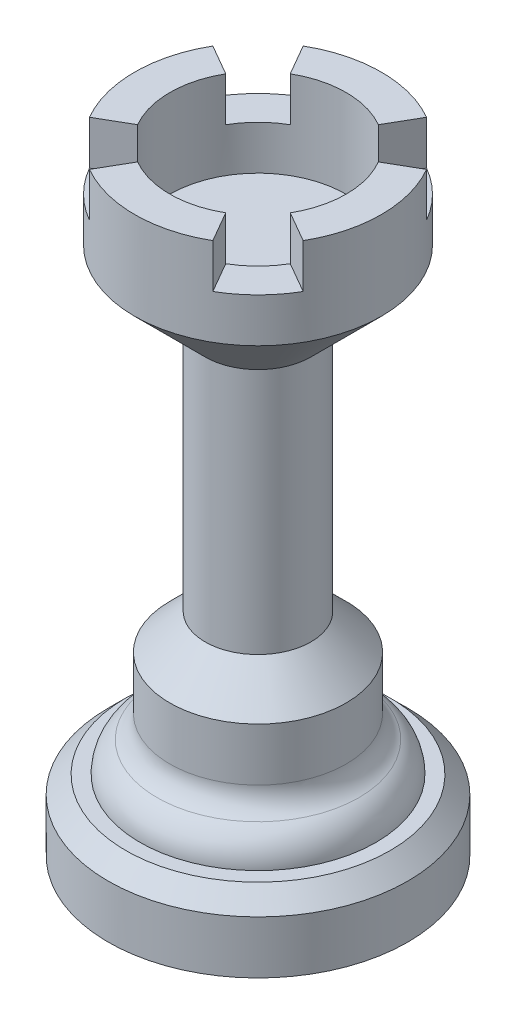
ISO-10303-21;
HEADER;
FILE_DESCRIPTION(('STEP AP214'),'2;1');
FILE_NAME('part.step','',(''),(''),'','','');
FILE_SCHEMA(('AUTOMOTIVE_DESIGN { 1 0 10303 214 1 1 1 1 }'));
ENDSEC;
DATA;
#1=APPLICATION_CONTEXT('core data for automotive mechanical design processes');
#2=APPLICATION_PROTOCOL_DEFINITION('international standard','automotive_design',2000,#1);
#3=PRODUCT_CONTEXT('',#1,'mechanical');
#4=PRODUCT('Part','Part','',(#3));
#5=PRODUCT_RELATED_PRODUCT_CATEGORY('part','',(#4));
#6=PRODUCT_DEFINITION_FORMATION('','',#4);
#7=PRODUCT_DEFINITION_CONTEXT('part definition',#1,'design');
#8=PRODUCT_DEFINITION('design','',#6,#7);
#9=PRODUCT_DEFINITION_SHAPE('','',#8);
#10=(LENGTH_UNIT() NAMED_UNIT(*) SI_UNIT(.MILLI.,.METRE.));
#11=(NAMED_UNIT(*) PLANE_ANGLE_UNIT() SI_UNIT($,.RADIAN.));
#12=(NAMED_UNIT(*) SI_UNIT($,.STERADIAN.) SOLID_ANGLE_UNIT());
#13=UNCERTAINTY_MEASURE_WITH_UNIT(LENGTH_MEASURE(1.E-05),#10,'distance_accuracy_value','');
#14=(GEOMETRIC_REPRESENTATION_CONTEXT(3) GLOBAL_UNCERTAINTY_ASSIGNED_CONTEXT((#13)) GLOBAL_UNIT_ASSIGNED_CONTEXT((#10,
#11,#12)) REPRESENTATION_CONTEXT('',''));
#15=CARTESIAN_POINT('',(0.,0.,0.));
#16=DIRECTION('',(0.,0.,1.));
#17=DIRECTION('',(1.,0.,0.));
#18=AXIS2_PLACEMENT_3D('',#15,#16,#17);
#19=CARTESIAN_POINT('',(5.95497668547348E-13,-173.601878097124,0.));
#20=DIRECTION('',(0.,-1.,0.));
#21=DIRECTION('',(1.,0.,0.));
#22=AXIS2_PLACEMENT_3D('',#19,#20,#21);
#23=CYLINDRICAL_SURFACE('',#22,14.0000000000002);
#24=CARTESIAN_POINT('',(-2.05814939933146E-13,59.9999999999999,0.));
#25=DIRECTION('',(0.,-1.,0.));
#26=DIRECTION('',(1.,0.,0.));
#27=AXIS2_PLACEMENT_3D('',#24,#25,#26);
#28=CIRCLE('',#27,14.0000000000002);
#29=CARTESIAN_POINT('',(14.,60.,0.));
#30=VERTEX_POINT('',#29);
#31=EDGE_CURVE('E271',#30,#30,#28,.T.);
#32=ORIENTED_EDGE('',*,*,#31,.F.);
#33=EDGE_LOOP('',(#32));
#34=FACE_BOUND('',#33,.T.);
#35=CARTESIAN_POINT('',(-2.40117429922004E-13,70.,0.));
#36=DIRECTION('',(0.,-1.,0.));
#37=DIRECTION('',(1.,0.,0.));
#38=AXIS2_PLACEMENT_3D('',#35,#36,#37);
#39=CIRCLE('',#38,14.0000000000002);
#40=CARTESIAN_POINT('',(12.1243556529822,70.,-7.00000000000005));
#41=VERTEX_POINT('',#40);
#42=CARTESIAN_POINT('',(12.1243556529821,70.,7.00000000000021));
#43=VERTEX_POINT('',#42);
#44=EDGE_CURVE('E268',#41,#43,#39,.T.);
#45=ORIENTED_EDGE('',*,*,#44,.T.);
#46=DIRECTION('',(0.,1.,0.));
#47=VECTOR('',#46,1.);
#48=CARTESIAN_POINT('',(12.1243556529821,65.,7.00000000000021));
#49=LINE('',#48,#47);
#50=CARTESIAN_POINT('',(12.1243556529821,65.,7.00000000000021));
#51=VERTEX_POINT('',#50);
#52=EDGE_CURVE('E179',#51,#43,#49,.T.);
#53=ORIENTED_EDGE('',*,*,#52,.F.);
#54=CARTESIAN_POINT('',(-2.22966184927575E-13,65.,0.));
#55=DIRECTION('',(0.,1.,0.));
#56=DIRECTION('',(0.,0.,-1.));
#57=AXIS2_PLACEMENT_3D('',#54,#55,#56);
#58=CIRCLE('',#57,14.0000000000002);
#59=CARTESIAN_POINT('',(6.99999999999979,65.,12.1243556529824));
#60=VERTEX_POINT('',#59);
#61=EDGE_CURVE('E164',#60,#51,#58,.T.);
#62=ORIENTED_EDGE('',*,*,#61,.F.);
#63=DIRECTION('',(0.,1.,0.));
#64=VECTOR('',#63,1.);
#65=CARTESIAN_POINT('',(6.99999999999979,65.,12.1243556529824));
#66=LINE('',#65,#64);
#67=CARTESIAN_POINT('',(6.99999999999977,70.,12.1243556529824));
#68=VERTEX_POINT('',#67);
#69=EDGE_CURVE('E162',#60,#68,#66,.T.);
#70=ORIENTED_EDGE('',*,*,#69,.T.);
#71=CARTESIAN_POINT('',(-7.00000000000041,70.,12.1243556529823));
#72=VERTEX_POINT('',#71);
#73=EDGE_CURVE('E272',#68,#72,#39,.T.);
#74=ORIENTED_EDGE('',*,*,#73,.T.);
#75=DIRECTION('',(0.,1.,0.));
#76=VECTOR('',#75,1.);
#77=CARTESIAN_POINT('',(-7.00000000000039,64.9999999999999,12.1243556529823));
#78=LINE('',#77,#76);
#79=CARTESIAN_POINT('',(-7.00000000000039,64.9999999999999,12.1243556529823));
#80=VERTEX_POINT('',#79);
#81=EDGE_CURVE('E199',#80,#72,#78,.T.);
#82=ORIENTED_EDGE('',*,*,#81,.F.);
#83=CARTESIAN_POINT('',(-2.22966184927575E-13,65.,0.));
#84=DIRECTION('',(0.,1.,0.));
#85=DIRECTION('',(1.,0.,0.));
#86=AXIS2_PLACEMENT_3D('',#83,#84,#85);
#87=CIRCLE('',#86,14.0000000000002);
#88=CARTESIAN_POINT('',(-12.1243556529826,64.9999999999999,7.00000000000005));
#89=VERTEX_POINT('',#88);
#90=EDGE_CURVE('E191',#89,#80,#87,.T.);
#91=ORIENTED_EDGE('',*,*,#90,.F.);
#92=DIRECTION('',(0.,1.,0.));
#93=VECTOR('',#92,1.);
#94=CARTESIAN_POINT('',(-12.1243556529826,64.9999999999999,7.00000000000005));
#95=LINE('',#94,#93);
#96=CARTESIAN_POINT('',(-12.1243556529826,69.9999999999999,7.00000000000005));
#97=VERTEX_POINT('',#96);
#98=EDGE_CURVE('E202',#89,#97,#95,.T.);
#99=ORIENTED_EDGE('',*,*,#98,.T.);
#100=CARTESIAN_POINT('',(-12.1243556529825,69.9999999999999,-7.00000000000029));
#101=VERTEX_POINT('',#100);
#102=EDGE_CURVE('E379',#97,#101,#39,.T.);
#103=ORIENTED_EDGE('',*,*,#102,.T.);
#104=DIRECTION('',(0.,1.,0.));
#105=VECTOR('',#104,1.);
#106=CARTESIAN_POINT('',(-12.1243556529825,64.9999999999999,-7.00000000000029));
#107=LINE('',#106,#105);
#108=CARTESIAN_POINT('',(-12.1243556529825,64.9999999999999,-7.00000000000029));
#109=VERTEX_POINT('',#108);
#110=EDGE_CURVE('E197',#109,#101,#107,.T.);
#111=ORIENTED_EDGE('',*,*,#110,.F.);
#112=CARTESIAN_POINT('',(-2.22966184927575E-13,65.,0.));
#113=DIRECTION('',(0.,1.,0.));
#114=DIRECTION('',(0.,0.,1.));
#115=AXIS2_PLACEMENT_3D('',#112,#113,#114);
#116=CIRCLE('',#115,14.0000000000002);
#117=CARTESIAN_POINT('',(-7.00000000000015,64.9999999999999,-12.1243556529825));
#118=VERTEX_POINT('',#117);
#119=EDGE_CURVE('E217',#118,#109,#116,.T.);
#120=ORIENTED_EDGE('',*,*,#119,.F.);
#121=DIRECTION('',(0.,1.,0.));
#122=VECTOR('',#121,1.);
#123=CARTESIAN_POINT('',(-7.00000000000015,64.9999999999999,-12.1243556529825));
#124=LINE('',#123,#122);
#125=CARTESIAN_POINT('',(-7.00000000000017,69.9999999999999,-12.1243556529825));
#126=VERTEX_POINT('',#125);
#127=EDGE_CURVE('E226',#118,#126,#124,.T.);
#128=ORIENTED_EDGE('',*,*,#127,.T.);
#129=CARTESIAN_POINT('',(6.99999999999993,70.,-12.1243556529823));
#130=VERTEX_POINT('',#129);
#131=EDGE_CURVE('E267',#126,#130,#39,.T.);
#132=ORIENTED_EDGE('',*,*,#131,.T.);
#133=DIRECTION('',(0.,1.,0.));
#134=VECTOR('',#133,1.);
#135=CARTESIAN_POINT('',(6.99999999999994,65.,-12.1243556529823));
#136=LINE('',#135,#134);
#137=CARTESIAN_POINT('',(6.99999999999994,65.,-12.1243556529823));
#138=VERTEX_POINT('',#137);
#139=EDGE_CURVE('E250',#138,#130,#136,.T.);
#140=ORIENTED_EDGE('',*,*,#139,.F.);
#141=CARTESIAN_POINT('',(-2.22966184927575E-13,65.,0.));
#142=DIRECTION('',(0.,1.,0.));
#143=DIRECTION('',(-1.,0.,0.));
#144=AXIS2_PLACEMENT_3D('',#141,#142,#143);
#145=CIRCLE('',#144,14.0000000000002);
#146=CARTESIAN_POINT('',(12.1243556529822,65.,-7.00000000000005));
#147=VERTEX_POINT('',#146);
#148=EDGE_CURVE('E242',#147,#138,#145,.T.);
#149=ORIENTED_EDGE('',*,*,#148,.F.);
#150=DIRECTION('',(0.,1.,0.));
#151=VECTOR('',#150,1.);
#152=CARTESIAN_POINT('',(12.1243556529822,65.,-7.00000000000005));
#153=LINE('',#152,#151);
#154=EDGE_CURVE('E254',#147,#41,#153,.T.);
#155=ORIENTED_EDGE('',*,*,#154,.T.);
#156=EDGE_LOOP('',(#45,#53,#62,#70,#74,#82,#91,#99,#103,#111,#120,#128,#132,#140,#149,#155));
#157=FACE_BOUND('',#156,.T.);
#158=ADVANCED_FACE('F41',(#34,#157),#23,.T.);
#159=CARTESIAN_POINT('',(14.,70.,0.));
#160=DIRECTION('',(0.,1.,0.));
#161=DIRECTION('',(-1.,0.,0.));
#162=AXIS2_PLACEMENT_3D('',#159,#160,#161);
#163=PLANE('',#162);
#164=CARTESIAN_POINT('',(-2.40117429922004E-13,70.,0.));
#165=DIRECTION('',(0.,-1.,0.));
#166=DIRECTION('',(1.,0.,0.));
#167=AXIS2_PLACEMENT_3D('',#164,#165,#166);
#168=CIRCLE('',#167,10.0000000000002);
#169=CARTESIAN_POINT('',(8.66025403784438,70.,-5.00000000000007));
#170=VERTEX_POINT('',#169);
#171=CARTESIAN_POINT('',(8.66025403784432,70.,5.00000000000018));
#172=VERTEX_POINT('',#171);
#173=EDGE_CURVE('E264',#170,#172,#168,.T.);
#174=ORIENTED_EDGE('',*,*,#173,.T.);
#175=DIRECTION('',(0.866025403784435,0.,0.500000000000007));
#176=VECTOR('',#175,1.);
#177=CARTESIAN_POINT('',(-2.40117429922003E-13,70.,0.));
#178=LINE('',#177,#176);
#179=EDGE_CURVE('E201',#172,#43,#178,.T.);
#180=ORIENTED_EDGE('',*,*,#179,.T.);
#181=ORIENTED_EDGE('',*,*,#44,.F.);
#182=DIRECTION('',(0.866025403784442,0.,-0.499999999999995));
#183=VECTOR('',#182,1.);
#184=CARTESIAN_POINT('',(-2.51170141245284E-13,70.,0.));
#185=LINE('',#184,#183);
#186=EDGE_CURVE('E236',#170,#41,#185,.T.);
#187=ORIENTED_EDGE('',*,*,#186,.F.);
#188=EDGE_LOOP('',(#174,#180,#181,#187));
#189=FACE_BOUND('',#188,.T.);
#190=ADVANCED_FACE('F309',(#189),#163,.T.);
#191=DIRECTION('',(0.499999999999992,0.,0.866025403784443));
#192=VECTOR('',#191,1.);
#193=CARTESIAN_POINT('',(-2.40117429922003E-13,70.,0.));
#194=LINE('',#193,#192);
#195=CARTESIAN_POINT('',(4.9999999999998,70.,8.66025403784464));
#196=VERTEX_POINT('',#195);
#197=EDGE_CURVE('E405',#196,#68,#194,.T.);
#198=ORIENTED_EDGE('',*,*,#197,.F.);
#199=CARTESIAN_POINT('',(-5.00000000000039,70.,8.66025403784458));
#200=VERTEX_POINT('',#199);
#201=EDGE_CURVE('E176',#196,#200,#168,.T.);
#202=ORIENTED_EDGE('',*,*,#201,.T.);
#203=DIRECTION('',(-0.500000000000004,0.,0.866025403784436));
#204=VECTOR('',#203,1.);
#205=CARTESIAN_POINT('',(-2.29064718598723E-13,70.,0.));
#206=LINE('',#205,#204);
#207=EDGE_CURVE('E194',#200,#72,#206,.T.);
#208=ORIENTED_EDGE('',*,*,#207,.T.);
#209=ORIENTED_EDGE('',*,*,#73,.F.);
#210=EDGE_LOOP('',(#198,#202,#208,#209));
#211=FACE_BOUND('',#210,.T.);
#212=ADVANCED_FACE('F315',(#211),#163,.T.);
#213=DIRECTION('',(-0.866025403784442,0.,0.499999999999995));
#214=VECTOR('',#213,1.);
#215=CARTESIAN_POINT('',(-2.29064718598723E-13,70.,0.));
#216=LINE('',#215,#214);
#217=CARTESIAN_POINT('',(-8.66025403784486,69.9999999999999,5.00000000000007));
#218=VERTEX_POINT('',#217);
#219=EDGE_CURVE('E186',#218,#97,#216,.T.);
#220=ORIENTED_EDGE('',*,*,#219,.F.);
#221=CARTESIAN_POINT('',(-8.66025403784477,69.9999999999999,-5.00000000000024));
#222=VERTEX_POINT('',#221);
#223=EDGE_CURVE('E377',#218,#222,#168,.T.);
#224=ORIENTED_EDGE('',*,*,#223,.T.);
#225=DIRECTION('',(-0.866025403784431,0.,-0.500000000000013));
#226=VECTOR('',#225,1.);
#227=CARTESIAN_POINT('',(-2.40117429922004E-13,70.,0.));
#228=LINE('',#227,#226);
#229=EDGE_CURVE('E221',#222,#101,#228,.T.);
#230=ORIENTED_EDGE('',*,*,#229,.T.);
#231=ORIENTED_EDGE('',*,*,#102,.F.);
#232=EDGE_LOOP('',(#220,#224,#230,#231));
#233=FACE_BOUND('',#232,.T.);
#234=ADVANCED_FACE('F360',(#233),#163,.T.);
#235=CARTESIAN_POINT('',(5.95497668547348E-13,-173.601878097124,0.));
#236=DIRECTION('',(0.,-1.,0.));
#237=DIRECTION('',(1.,0.,0.));
#238=AXIS2_PLACEMENT_3D('',#235,#236,#237);
#239=CYLINDRICAL_SURFACE('',#238,10.0000000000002);
#240=CARTESIAN_POINT('',(-2.05814939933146E-13,60.,0.));
#241=DIRECTION('',(0.,-1.,0.));
#242=DIRECTION('',(1.,0.,0.));
#243=AXIS2_PLACEMENT_3D('',#240,#241,#242);
#244=CIRCLE('',#243,10.0000000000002);
#245=CARTESIAN_POINT('',(10.,60.,0.));
#246=VERTEX_POINT('',#245);
#247=EDGE_CURVE('E253',#246,#246,#244,.T.);
#248=ORIENTED_EDGE('',*,*,#247,.T.);
#249=EDGE_LOOP('',(#248));
#250=FACE_BOUND('',#249,.T.);
#251=CARTESIAN_POINT('',(-2.22966184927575E-13,65.,0.));
#252=DIRECTION('',(0.,1.,0.));
#253=DIRECTION('',(0.,0.,-1.));
#254=AXIS2_PLACEMENT_3D('',#251,#252,#253);
#255=CIRCLE('',#254,10.0000000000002);
#256=CARTESIAN_POINT('',(8.66025403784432,65.,5.00000000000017));
#257=VERTEX_POINT('',#256);
#258=CARTESIAN_POINT('',(4.99999999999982,65.,8.66025403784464));
#259=VERTEX_POINT('',#258);
#260=EDGE_CURVE('E165',#257,#259,#255,.F.);
#261=ORIENTED_EDGE('',*,*,#260,.F.);
#262=DIRECTION('',(0.,1.,0.));
#263=VECTOR('',#262,1.);
#264=CARTESIAN_POINT('',(8.66025403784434,65.,5.00000000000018));
#265=LINE('',#264,#263);
#266=EDGE_CURVE('E177',#257,#172,#265,.T.);
#267=ORIENTED_EDGE('',*,*,#266,.T.);
#268=ORIENTED_EDGE('',*,*,#173,.F.);
#269=DIRECTION('',(0.,1.,0.));
#270=VECTOR('',#269,1.);
#271=CARTESIAN_POINT('',(8.6602540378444,65.,-5.00000000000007));
#272=LINE('',#271,#270);
#273=CARTESIAN_POINT('',(8.6602540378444,65.,-5.00000000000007));
#274=VERTEX_POINT('',#273);
#275=EDGE_CURVE('E257',#274,#170,#272,.T.);
#276=ORIENTED_EDGE('',*,*,#275,.F.);
#277=CARTESIAN_POINT('',(-2.22966184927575E-13,65.,0.));
#278=DIRECTION('',(0.,1.,0.));
#279=DIRECTION('',(-1.,0.,0.));
#280=AXIS2_PLACEMENT_3D('',#277,#278,#279);
#281=CIRCLE('',#280,10.0000000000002);
#282=CARTESIAN_POINT('',(4.99999999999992,65.,-8.66025403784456));
#283=VERTEX_POINT('',#282);
#284=EDGE_CURVE('E235',#283,#274,#281,.F.);
#285=ORIENTED_EDGE('',*,*,#284,.F.);
#286=DIRECTION('',(0.,1.,0.));
#287=VECTOR('',#286,1.);
#288=CARTESIAN_POINT('',(4.99999999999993,65.,-8.66025403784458));
#289=LINE('',#288,#287);
#290=CARTESIAN_POINT('',(4.99999999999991,70.,-8.66025403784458));
#291=VERTEX_POINT('',#290);
#292=EDGE_CURVE('E245',#283,#291,#289,.T.);
#293=ORIENTED_EDGE('',*,*,#292,.T.);
#294=CARTESIAN_POINT('',(-5.00000000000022,70.,-8.66025403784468));
#295=VERTEX_POINT('',#294);
#296=EDGE_CURVE('E263',#295,#291,#168,.T.);
#297=ORIENTED_EDGE('',*,*,#296,.F.);
#298=DIRECTION('',(0.,1.,0.));
#299=VECTOR('',#298,1.);
#300=CARTESIAN_POINT('',(-5.00000000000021,64.9999999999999,-8.66025403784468));
#301=LINE('',#300,#299);
#302=CARTESIAN_POINT('',(-5.00000000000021,64.9999999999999,-8.66025403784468));
#303=VERTEX_POINT('',#302);
#304=EDGE_CURVE('E229',#303,#295,#301,.T.);
#305=ORIENTED_EDGE('',*,*,#304,.F.);
#306=CARTESIAN_POINT('',(-2.22966184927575E-13,65.,0.));
#307=DIRECTION('',(0.,1.,0.));
#308=DIRECTION('',(0.,0.,1.));
#309=AXIS2_PLACEMENT_3D('',#306,#307,#308);
#310=CIRCLE('',#309,10.0000000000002);
#311=CARTESIAN_POINT('',(-8.66025403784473,64.9999999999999,-5.00000000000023));
#312=VERTEX_POINT('',#311);
#313=EDGE_CURVE('E210',#312,#303,#310,.F.);
#314=ORIENTED_EDGE('',*,*,#313,.F.);
#315=DIRECTION('',(0.,1.,0.));
#316=VECTOR('',#315,1.);
#317=CARTESIAN_POINT('',(-8.66025403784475,64.9999999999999,-5.00000000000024));
#318=LINE('',#317,#316);
#319=EDGE_CURVE('E220',#312,#222,#318,.T.);
#320=ORIENTED_EDGE('',*,*,#319,.T.);
#321=ORIENTED_EDGE('',*,*,#223,.F.);
#322=DIRECTION('',(0.,1.,0.));
#323=VECTOR('',#322,1.);
#324=CARTESIAN_POINT('',(-8.66025403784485,64.9999999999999,5.00000000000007));
#325=LINE('',#324,#323);
#326=CARTESIAN_POINT('',(-8.66025403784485,64.9999999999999,5.00000000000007));
#327=VERTEX_POINT('',#326);
#328=EDGE_CURVE('E205',#327,#218,#325,.T.);
#329=ORIENTED_EDGE('',*,*,#328,.F.);
#330=CARTESIAN_POINT('',(-2.22966184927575E-13,65.,0.));
#331=DIRECTION('',(0.,1.,0.));
#332=DIRECTION('',(1.,0.,0.));
#333=AXIS2_PLACEMENT_3D('',#330,#331,#332);
#334=CIRCLE('',#333,10.0000000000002);
#335=CARTESIAN_POINT('',(-5.00000000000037,65.,8.66025403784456));
#336=VERTEX_POINT('',#335);
#337=EDGE_CURVE('E185',#336,#327,#334,.F.);
#338=ORIENTED_EDGE('',*,*,#337,.F.);
#339=DIRECTION('',(0.,1.,0.));
#340=VECTOR('',#339,1.);
#341=CARTESIAN_POINT('',(-5.00000000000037,64.9999999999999,8.66025403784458));
#342=LINE('',#341,#340);
#343=EDGE_CURVE('E193',#336,#200,#342,.T.);
#344=ORIENTED_EDGE('',*,*,#343,.T.);
#345=ORIENTED_EDGE('',*,*,#201,.F.);
#346=DIRECTION('',(0.,1.,0.));
#347=VECTOR('',#346,1.);
#348=CARTESIAN_POINT('',(4.99999999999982,65.,8.66025403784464));
#349=LINE('',#348,#347);
#350=EDGE_CURVE('E159',#259,#196,#349,.T.);
#351=ORIENTED_EDGE('',*,*,#350,.F.);
#352=EDGE_LOOP('',(#261,#267,#268,#276,#285,#293,#297,#305,#314,#320,#321,#329,#338,#344,#345,#351));
#353=FACE_BOUND('',#352,.T.);
#354=ADVANCED_FACE('F173',(#250,#353),#239,.F.);
#355=DIRECTION('',(-0.499999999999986,0.,-0.866025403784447));
#356=VECTOR('',#355,1.);
#357=CARTESIAN_POINT('',(-2.40117429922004E-13,70.,0.));
#358=LINE('',#357,#356);
#359=EDGE_CURVE('E211',#295,#126,#358,.T.);
#360=ORIENTED_EDGE('',*,*,#359,.F.);
#361=ORIENTED_EDGE('',*,*,#296,.T.);
#362=DIRECTION('',(0.500000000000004,0.,-0.866025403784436));
#363=VECTOR('',#362,1.);
#364=CARTESIAN_POINT('',(-2.51170141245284E-13,70.,0.));
#365=LINE('',#364,#363);
#366=EDGE_CURVE('E246',#291,#130,#365,.T.);
#367=ORIENTED_EDGE('',*,*,#366,.T.);
#368=ORIENTED_EDGE('',*,*,#131,.F.);
#369=EDGE_LOOP('',(#360,#361,#367,#368));
#370=FACE_BOUND('',#369,.T.);
#371=ADVANCED_FACE('F318',(#370),#163,.T.);
#372=CARTESIAN_POINT('',(0.,0.,0.));
#373=DIRECTION('',(0.,-1.,0.));
#374=DIRECTION('',(1.,0.,0.));
#375=AXIS2_PLACEMENT_3D('',#372,#373,#374);
#376=PLANE('',#375);
#377=CARTESIAN_POINT('',(0.,0.,0.));
#378=DIRECTION('',(0.,-1.,0.));
#379=DIRECTION('',(1.,0.,0.));
#380=AXIS2_PLACEMENT_3D('',#377,#378,#379);
#381=CIRCLE('',#380,17.);
#382=CARTESIAN_POINT('',(17.,0.,0.));
#383=VERTEX_POINT('',#382);
#384=EDGE_CURVE('E293',#383,#383,#381,.T.);
#385=ORIENTED_EDGE('',*,*,#384,.T.);
#386=EDGE_LOOP('',(#385));
#387=FACE_BOUND('',#386,.T.);
#388=ADVANCED_FACE('F353',(#387),#376,.T.);
#389=CARTESIAN_POINT('',(5.95497668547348E-13,-173.601878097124,0.));
#390=DIRECTION('',(0.,-1.,0.));
#391=DIRECTION('',(1.,0.,0.));
#392=AXIS2_PLACEMENT_3D('',#389,#390,#391);
#393=CYLINDRICAL_SURFACE('',#392,17.);
#394=CARTESIAN_POINT('',(0.,5.99999999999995,0.));
#395=DIRECTION('',(0.,1.,0.));
#396=DIRECTION('',(-1.,0.,0.));
#397=AXIS2_PLACEMENT_3D('',#394,#395,#396);
#398=CIRCLE('',#397,17.);
#399=CARTESIAN_POINT('',(-17.,5.99999999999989,0.));
#400=VERTEX_POINT('',#399);
#401=EDGE_CURVE('E50',#400,#400,#398,.F.);
#402=ORIENTED_EDGE('',*,*,#401,.T.);
#403=EDGE_LOOP('',(#402));
#404=FACE_BOUND('',#403,.T.);
#405=ORIENTED_EDGE('',*,*,#384,.F.);
#406=EDGE_LOOP('',(#405));
#407=FACE_BOUND('',#406,.T.);
#408=ADVANCED_FACE('F298',(#404,#407),#393,.T.);
#409=CARTESIAN_POINT('',(17.,8.00000000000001,0.));
#410=DIRECTION('',(0.,1.,0.));
#411=DIRECTION('',(-1.,0.,0.));
#412=AXIS2_PLACEMENT_3D('',#409,#410,#411);
#413=PLANE('',#412);
#414=CARTESIAN_POINT('',(0.,7.99999999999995,0.));
#415=DIRECTION('',(0.,1.,0.));
#416=DIRECTION('',(-1.,0.,0.));
#417=AXIS2_PLACEMENT_3D('',#414,#415,#416);
#418=CIRCLE('',#417,15.);
#419=CARTESIAN_POINT('',(-15.,7.9999999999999,0.));
#420=VERTEX_POINT('',#419);
#421=EDGE_CURVE('E12',#420,#420,#418,.T.);
#422=ORIENTED_EDGE('',*,*,#421,.T.);
#423=EDGE_LOOP('',(#422));
#424=FACE_BOUND('',#423,.T.);
#425=CARTESIAN_POINT('',(0.,7.99999999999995,0.));
#426=DIRECTION('',(0.,-1.,0.));
#427=DIRECTION('',(1.,0.,0.));
#428=AXIS2_PLACEMENT_3D('',#425,#426,#427);
#429=CIRCLE('',#428,13.394448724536);
#430=CARTESIAN_POINT('',(13.394448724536,8.,0.));
#431=VERTEX_POINT('',#430);
#432=EDGE_CURVE('E290',#431,#431,#429,.T.);
#433=ORIENTED_EDGE('',*,*,#432,.T.);
#434=EDGE_LOOP('',(#433));
#435=FACE_BOUND('',#434,.T.);
#436=ADVANCED_FACE('F347',(#424,#435),#413,.T.);
#437=CARTESIAN_POINT('',(0.,7.99999999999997,0.));
#438=DIRECTION('',(0.,-1.,0.));
#439=DIRECTION('',(1.,0.,0.));
#440=AXIS2_PLACEMENT_3D('',#437,#438,#439);
#441=TOROIDAL_SURFACE('',#440,9.39444872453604,4.);
#442=CARTESIAN_POINT('',(0.,11.4285714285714,0.));
#443=DIRECTION('',(0.,-1.,0.));
#444=DIRECTION('',(1.,0.,0.));
#445=AXIS2_PLACEMENT_3D('',#442,#443,#444);
#446=CIRCLE('',#445,11.4547637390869);
#447=CARTESIAN_POINT('',(11.4547637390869,11.4285714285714,0.));
#448=VERTEX_POINT('',#447);
#449=EDGE_CURVE('E287',#448,#448,#446,.T.);
#450=ORIENTED_EDGE('',*,*,#449,.T.);
#451=EDGE_LOOP('',(#450));
#452=FACE_BOUND('',#451,.T.);
#453=ORIENTED_EDGE('',*,*,#432,.F.);
#454=EDGE_LOOP('',(#453));
#455=FACE_BOUND('',#454,.T.);
#456=ADVANCED_FACE('F343',(#452,#455),#441,.T.);
#457=CARTESIAN_POINT('',(0.,13.9999999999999,0.));
#458=DIRECTION('',(0.,-1.,0.));
#459=DIRECTION('',(1.,0.,0.));
#460=AXIS2_PLACEMENT_3D('',#457,#458,#459);
#461=TOROIDAL_SURFACE('',#460,13.,3.);
#462=CARTESIAN_POINT('',(0.,14.,0.));
#463=DIRECTION('',(0.,-1.,0.));
#464=DIRECTION('',(1.,0.,0.));
#465=AXIS2_PLACEMENT_3D('',#462,#463,#464);
#466=CIRCLE('',#465,10.);
#467=CARTESIAN_POINT('',(10.,14.,0.));
#468=VERTEX_POINT('',#467);
#469=EDGE_CURVE('E284',#468,#468,#466,.T.);
#470=ORIENTED_EDGE('',*,*,#469,.T.);
#471=EDGE_LOOP('',(#470));
#472=FACE_BOUND('',#471,.T.);
#473=ORIENTED_EDGE('',*,*,#449,.F.);
#474=EDGE_LOOP('',(#473));
#475=FACE_BOUND('',#474,.T.);
#476=ADVANCED_FACE('F339',(#472,#475),#461,.F.);
#477=CARTESIAN_POINT('',(5.95497668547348E-13,-173.601878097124,0.));
#478=DIRECTION('',(0.,-1.,0.));
#479=DIRECTION('',(1.,0.,0.));
#480=AXIS2_PLACEMENT_3D('',#477,#478,#479);
#481=CYLINDRICAL_SURFACE('',#480,10.0000000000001);
#482=CARTESIAN_POINT('',(0.,20.,0.));
#483=DIRECTION('',(0.,-1.,0.));
#484=DIRECTION('',(1.,0.,0.));
#485=AXIS2_PLACEMENT_3D('',#482,#483,#484);
#486=CIRCLE('',#485,10.0000000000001);
#487=CARTESIAN_POINT('',(10.,20.,0.));
#488=VERTEX_POINT('',#487);
#489=EDGE_CURVE('E281',#488,#488,#486,.T.);
#490=ORIENTED_EDGE('',*,*,#489,.T.);
#491=EDGE_LOOP('',(#490));
#492=FACE_BOUND('',#491,.T.);
#493=ORIENTED_EDGE('',*,*,#469,.F.);
#494=EDGE_LOOP('',(#493));
#495=FACE_BOUND('',#494,.T.);
#496=ADVANCED_FACE('F335',(#492,#495),#481,.T.);
#497=CARTESIAN_POINT('',(0.,20.,0.));
#498=DIRECTION('',(0.,-1.,0.));
#499=DIRECTION('',(1.,0.,0.));
#500=AXIS2_PLACEMENT_3D('',#497,#498,#499);
#501=CONICAL_SURFACE('',#500,10.0000000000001,0.785398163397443);
#502=CARTESIAN_POINT('',(0.,24.,0.));
#503=DIRECTION('',(0.,-1.,0.));
#504=DIRECTION('',(1.,0.,0.));
#505=AXIS2_PLACEMENT_3D('',#502,#503,#504);
#506=CIRCLE('',#505,6.00000000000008);
#507=CARTESIAN_POINT('',(6.,24.,0.));
#508=VERTEX_POINT('',#507);
#509=EDGE_CURVE('E278',#508,#508,#506,.T.);
#510=ORIENTED_EDGE('',*,*,#509,.T.);
#511=EDGE_LOOP('',(#510));
#512=FACE_BOUND('',#511,.T.);
#513=ORIENTED_EDGE('',*,*,#489,.F.);
#514=EDGE_LOOP('',(#513));
#515=FACE_BOUND('',#514,.T.);
#516=ADVANCED_FACE('F331',(#512,#515),#501,.T.);
#517=CARTESIAN_POINT('',(5.95497668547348E-13,-173.601878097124,0.));
#518=DIRECTION('',(0.,-1.,0.));
#519=DIRECTION('',(1.,0.,0.));
#520=AXIS2_PLACEMENT_3D('',#517,#518,#519);
#521=CYLINDRICAL_SURFACE('',#520,6.00000000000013);
#522=CARTESIAN_POINT('',(-1.7837294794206E-13,52.,0.));
#523=DIRECTION('',(0.,-1.,0.));
#524=DIRECTION('',(1.,0.,0.));
#525=AXIS2_PLACEMENT_3D('',#522,#523,#524);
#526=CIRCLE('',#525,6.00000000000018);
#527=CARTESIAN_POINT('',(6.,52.,0.));
#528=VERTEX_POINT('',#527);
#529=EDGE_CURVE('E275',#528,#528,#526,.T.);
#530=ORIENTED_EDGE('',*,*,#529,.T.);
#531=EDGE_LOOP('',(#530));
#532=FACE_BOUND('',#531,.T.);
#533=ORIENTED_EDGE('',*,*,#509,.F.);
#534=EDGE_LOOP('',(#533));
#535=FACE_BOUND('',#534,.T.);
#536=ADVANCED_FACE('F327',(#532,#535),#521,.T.);
#537=CARTESIAN_POINT('',(-1.7837294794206E-13,52.,0.));
#538=DIRECTION('',(0.,1.,0.));
#539=DIRECTION('',(-1.,0.,0.));
#540=AXIS2_PLACEMENT_3D('',#537,#538,#539);
#541=CONICAL_SURFACE('',#540,6.00000000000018,0.785398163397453);
#542=ORIENTED_EDGE('',*,*,#31,.T.);
#543=EDGE_LOOP('',(#542));
#544=FACE_BOUND('',#543,.T.);
#545=ORIENTED_EDGE('',*,*,#529,.F.);
#546=EDGE_LOOP('',(#545));
#547=FACE_BOUND('',#546,.T.);
#548=ADVANCED_FACE('F323',(#544,#547),#541,.T.);
#549=CARTESIAN_POINT('',(10.,60.,0.));
#550=DIRECTION('',(0.,1.,0.));
#551=DIRECTION('',(-1.,0.,0.));
#552=AXIS2_PLACEMENT_3D('',#549,#550,#551);
#553=PLANE('',#552);
#554=ORIENTED_EDGE('',*,*,#247,.F.);
#555=EDGE_LOOP('',(#554));
#556=FACE_BOUND('',#555,.T.);
#557=ADVANCED_FACE('F326',(#556),#553,.T.);
#558=CARTESIAN_POINT('',(-2.34018896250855E-13,65.,0.));
#559=DIRECTION('',(0.866025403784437,0.,0.500000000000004));
#560=DIRECTION('',(0.500000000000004,0.,-0.866025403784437));
#561=AXIS2_PLACEMENT_3D('',#558,#559,#560);
#562=PLANE('',#561);
#563=ORIENTED_EDGE('',*,*,#366,.F.);
#564=ORIENTED_EDGE('',*,*,#292,.F.);
#565=DIRECTION('',(0.500000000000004,0.,-0.866025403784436));
#566=VECTOR('',#565,1.);
#567=CARTESIAN_POINT('',(-2.34018896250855E-13,65.,0.));
#568=LINE('',#567,#566);
#569=EDGE_CURVE('E233',#283,#138,#568,.T.);
#570=ORIENTED_EDGE('',*,*,#569,.T.);
#571=ORIENTED_EDGE('',*,*,#139,.T.);
#572=EDGE_LOOP('',(#563,#564,#570,#571));
#573=FACE_BOUND('',#572,.T.);
#574=ADVANCED_FACE('F391',(#573),#562,.T.);
#575=CARTESIAN_POINT('',(-2.34018896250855E-13,65.,0.));
#576=DIRECTION('',(0.499999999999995,0.,0.866025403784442));
#577=DIRECTION('',(0.866025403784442,0.,-0.499999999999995));
#578=AXIS2_PLACEMENT_3D('',#575,#576,#577);
#579=PLANE('',#578);
#580=ORIENTED_EDGE('',*,*,#186,.T.);
#581=ORIENTED_EDGE('',*,*,#154,.F.);
#582=DIRECTION('',(0.866025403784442,0.,-0.499999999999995));
#583=VECTOR('',#582,1.);
#584=CARTESIAN_POINT('',(-2.34018896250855E-13,65.,0.));
#585=LINE('',#584,#583);
#586=EDGE_CURVE('E239',#274,#147,#585,.T.);
#587=ORIENTED_EDGE('',*,*,#586,.F.);
#588=ORIENTED_EDGE('',*,*,#275,.T.);
#589=EDGE_LOOP('',(#580,#581,#587,#588));
#590=FACE_BOUND('',#589,.T.);
#591=ADVANCED_FACE('F435',(#590),#579,.F.);
#592=CARTESIAN_POINT('',(-2.34018896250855E-13,65.,0.));
#593=DIRECTION('',(0.,1.,0.));
#594=DIRECTION('',(-1.,0.,0.));
#595=AXIS2_PLACEMENT_3D('',#592,#593,#594);
#596=PLANE('',#595);
#597=ORIENTED_EDGE('',*,*,#569,.F.);
#598=ORIENTED_EDGE('',*,*,#284,.T.);
#599=ORIENTED_EDGE('',*,*,#586,.T.);
#600=ORIENTED_EDGE('',*,*,#148,.T.);
#601=EDGE_LOOP('',(#597,#598,#599,#600));
#602=FACE_BOUND('',#601,.T.);
#603=ADVANCED_FACE('F397',(#602),#596,.T.);
#604=CARTESIAN_POINT('',(-2.22966184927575E-13,65.,0.));
#605=DIRECTION('',(0.500000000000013,0.,-0.866025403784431));
#606=DIRECTION('',(-0.866025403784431,0.,-0.500000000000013));
#607=AXIS2_PLACEMENT_3D('',#604,#605,#606);
#608=PLANE('',#607);
#609=ORIENTED_EDGE('',*,*,#229,.F.);
#610=ORIENTED_EDGE('',*,*,#319,.F.);
#611=DIRECTION('',(-0.866025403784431,0.,-0.500000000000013));
#612=VECTOR('',#611,1.);
#613=CARTESIAN_POINT('',(-2.22966184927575E-13,65.,0.));
#614=LINE('',#613,#612);
#615=EDGE_CURVE('E208',#312,#109,#614,.T.);
#616=ORIENTED_EDGE('',*,*,#615,.T.);
#617=ORIENTED_EDGE('',*,*,#110,.T.);
#618=EDGE_LOOP('',(#609,#610,#616,#617));
#619=FACE_BOUND('',#618,.T.);
#620=ADVANCED_FACE('F428',(#619),#608,.T.);
#621=CARTESIAN_POINT('',(-2.22966184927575E-13,65.,0.));
#622=DIRECTION('',(0.866025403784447,0.,-0.499999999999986));
#623=DIRECTION('',(-0.499999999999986,0.,-0.866025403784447));
#624=AXIS2_PLACEMENT_3D('',#621,#622,#623);
#625=PLANE('',#624);
#626=ORIENTED_EDGE('',*,*,#359,.T.);
#627=ORIENTED_EDGE('',*,*,#127,.F.);
#628=DIRECTION('',(-0.499999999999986,0.,-0.866025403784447));
#629=VECTOR('',#628,1.);
#630=CARTESIAN_POINT('',(-2.22966184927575E-13,65.,0.));
#631=LINE('',#630,#629);
#632=EDGE_CURVE('E214',#303,#118,#631,.T.);
#633=ORIENTED_EDGE('',*,*,#632,.F.);
#634=ORIENTED_EDGE('',*,*,#304,.T.);
#635=EDGE_LOOP('',(#626,#627,#633,#634));
#636=FACE_BOUND('',#635,.T.);
#637=ADVANCED_FACE('F424',(#636),#625,.F.);
#638=CARTESIAN_POINT('',(-2.22966184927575E-13,65.,0.));
#639=DIRECTION('',(0.,1.,0.));
#640=DIRECTION('',(0.,0.,1.));
#641=AXIS2_PLACEMENT_3D('',#638,#639,#640);
#642=PLANE('',#641);
#643=ORIENTED_EDGE('',*,*,#615,.F.);
#644=ORIENTED_EDGE('',*,*,#313,.T.);
#645=ORIENTED_EDGE('',*,*,#632,.T.);
#646=ORIENTED_EDGE('',*,*,#119,.T.);
#647=EDGE_LOOP('',(#643,#644,#645,#646));
#648=FACE_BOUND('',#647,.T.);
#649=ADVANCED_FACE('F418',(#648),#642,.T.);
#650=CARTESIAN_POINT('',(-2.11913473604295E-13,65.,0.));
#651=DIRECTION('',(-0.866025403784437,0.,-0.500000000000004));
#652=DIRECTION('',(-0.500000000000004,0.,0.866025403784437));
#653=AXIS2_PLACEMENT_3D('',#650,#651,#652);
#654=PLANE('',#653);
#655=ORIENTED_EDGE('',*,*,#207,.F.);
#656=ORIENTED_EDGE('',*,*,#343,.F.);
#657=DIRECTION('',(-0.500000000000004,0.,0.866025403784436));
#658=VECTOR('',#657,1.);
#659=CARTESIAN_POINT('',(-2.11913473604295E-13,65.,0.));
#660=LINE('',#659,#658);
#661=EDGE_CURVE('E65',#336,#80,#660,.T.);
#662=ORIENTED_EDGE('',*,*,#661,.T.);
#663=ORIENTED_EDGE('',*,*,#81,.T.);
#664=EDGE_LOOP('',(#655,#656,#662,#663));
#665=FACE_BOUND('',#664,.T.);
#666=ADVANCED_FACE('F407',(#665),#654,.T.);
#667=CARTESIAN_POINT('',(-2.11913473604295E-13,65.,0.));
#668=DIRECTION('',(-0.499999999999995,0.,-0.866025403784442));
#669=DIRECTION('',(-0.866025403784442,0.,0.499999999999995));
#670=AXIS2_PLACEMENT_3D('',#667,#668,#669);
#671=PLANE('',#670);
#672=ORIENTED_EDGE('',*,*,#219,.T.);
#673=ORIENTED_EDGE('',*,*,#98,.F.);
#674=DIRECTION('',(-0.866025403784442,0.,0.499999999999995));
#675=VECTOR('',#674,1.);
#676=CARTESIAN_POINT('',(-2.11913473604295E-13,65.,0.));
#677=LINE('',#676,#675);
#678=EDGE_CURVE('E188',#327,#89,#677,.T.);
#679=ORIENTED_EDGE('',*,*,#678,.F.);
#680=ORIENTED_EDGE('',*,*,#328,.T.);
#681=EDGE_LOOP('',(#672,#673,#679,#680));
#682=FACE_BOUND('',#681,.T.);
#683=ADVANCED_FACE('F409',(#682),#671,.F.);
#684=CARTESIAN_POINT('',(-2.11913473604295E-13,65.,0.));
#685=DIRECTION('',(0.,1.,0.));
#686=DIRECTION('',(1.,0.,0.));
#687=AXIS2_PLACEMENT_3D('',#684,#685,#686);
#688=PLANE('',#687);
#689=ORIENTED_EDGE('',*,*,#661,.F.);
#690=ORIENTED_EDGE('',*,*,#337,.T.);
#691=ORIENTED_EDGE('',*,*,#678,.T.);
#692=ORIENTED_EDGE('',*,*,#90,.T.);
#693=EDGE_LOOP('',(#689,#690,#691,#692));
#694=FACE_BOUND('',#693,.T.);
#695=ADVANCED_FACE('F408',(#694),#688,.T.);
#696=CARTESIAN_POINT('',(-2.22966184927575E-13,65.,0.));
#697=DIRECTION('',(-0.500000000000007,0.,0.866025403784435));
#698=DIRECTION('',(0.866025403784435,0.,0.500000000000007));
#699=AXIS2_PLACEMENT_3D('',#696,#697,#698);
#700=PLANE('',#699);
#701=ORIENTED_EDGE('',*,*,#179,.F.);
#702=ORIENTED_EDGE('',*,*,#266,.F.);
#703=DIRECTION('',(0.866025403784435,0.,0.500000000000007));
#704=VECTOR('',#703,1.);
#705=CARTESIAN_POINT('',(-2.22966184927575E-13,65.,0.));
#706=LINE('',#705,#704);
#707=EDGE_CURVE('E57',#257,#51,#706,.T.);
#708=ORIENTED_EDGE('',*,*,#707,.T.);
#709=ORIENTED_EDGE('',*,*,#52,.T.);
#710=EDGE_LOOP('',(#701,#702,#708,#709));
#711=FACE_BOUND('',#710,.T.);
#712=ADVANCED_FACE('F416',(#711),#700,.T.);
#713=CARTESIAN_POINT('',(-2.22966184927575E-13,65.,0.));
#714=DIRECTION('',(-0.866025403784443,0.,0.499999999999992));
#715=DIRECTION('',(0.499999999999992,0.,0.866025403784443));
#716=AXIS2_PLACEMENT_3D('',#713,#714,#715);
#717=PLANE('',#716);
#718=ORIENTED_EDGE('',*,*,#197,.T.);
#719=ORIENTED_EDGE('',*,*,#69,.F.);
#720=DIRECTION('',(0.499999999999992,0.,0.866025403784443));
#721=VECTOR('',#720,1.);
#722=CARTESIAN_POINT('',(-2.22966184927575E-13,65.,0.));
#723=LINE('',#722,#721);
#724=EDGE_CURVE('E156',#259,#60,#723,.T.);
#725=ORIENTED_EDGE('',*,*,#724,.F.);
#726=ORIENTED_EDGE('',*,*,#350,.T.);
#727=EDGE_LOOP('',(#718,#719,#725,#726));
#728=FACE_BOUND('',#727,.T.);
#729=ADVANCED_FACE('F157',(#728),#717,.F.);
#730=CARTESIAN_POINT('',(-2.22966184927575E-13,65.,0.));
#731=DIRECTION('',(0.,1.,0.));
#732=DIRECTION('',(0.,0.,-1.));
#733=AXIS2_PLACEMENT_3D('',#730,#731,#732);
#734=PLANE('',#733);
#735=ORIENTED_EDGE('',*,*,#707,.F.);
#736=ORIENTED_EDGE('',*,*,#260,.T.);
#737=ORIENTED_EDGE('',*,*,#724,.T.);
#738=ORIENTED_EDGE('',*,*,#61,.T.);
#739=EDGE_LOOP('',(#735,#736,#737,#738));
#740=FACE_BOUND('',#739,.T.);
#741=ADVANCED_FACE('F168',(#740),#734,.T.);
#742=CARTESIAN_POINT('',(0.,5.99999999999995,0.));
#743=DIRECTION('',(0.,-1.,0.));
#744=DIRECTION('',(1.,0.,0.));
#745=AXIS2_PLACEMENT_3D('',#742,#743,#744);
#746=CONICAL_SURFACE('',#745,17.,0.785398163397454);
#747=ORIENTED_EDGE('',*,*,#421,.F.);
#748=EDGE_LOOP('',(#747));
#749=FACE_BOUND('',#748,.T.);
#750=ORIENTED_EDGE('',*,*,#401,.F.);
#751=EDGE_LOOP('',(#750));
#752=FACE_BOUND('',#751,.T.);
#753=ADVANCED_FACE('F44',(#749,#752),#746,.T.);
#754=CLOSED_SHELL('',(#158,#190,#212,#234,#354,#371,#388,#408,#436,#456,#476,#496,#516,#536,
#548,#557,#574,#591,#603,#620,#637,#649,#666,#683,#695,#712,#729,#741,#753));
#755=MANIFOLD_SOLID_BREP('B2',#754);
#756=ADVANCED_BREP_SHAPE_REPRESENTATION('',(#18,#755),#14);
#757=SHAPE_DEFINITION_REPRESENTATION(#9,#756);
ENDSEC;
END-ISO-10303-21;
